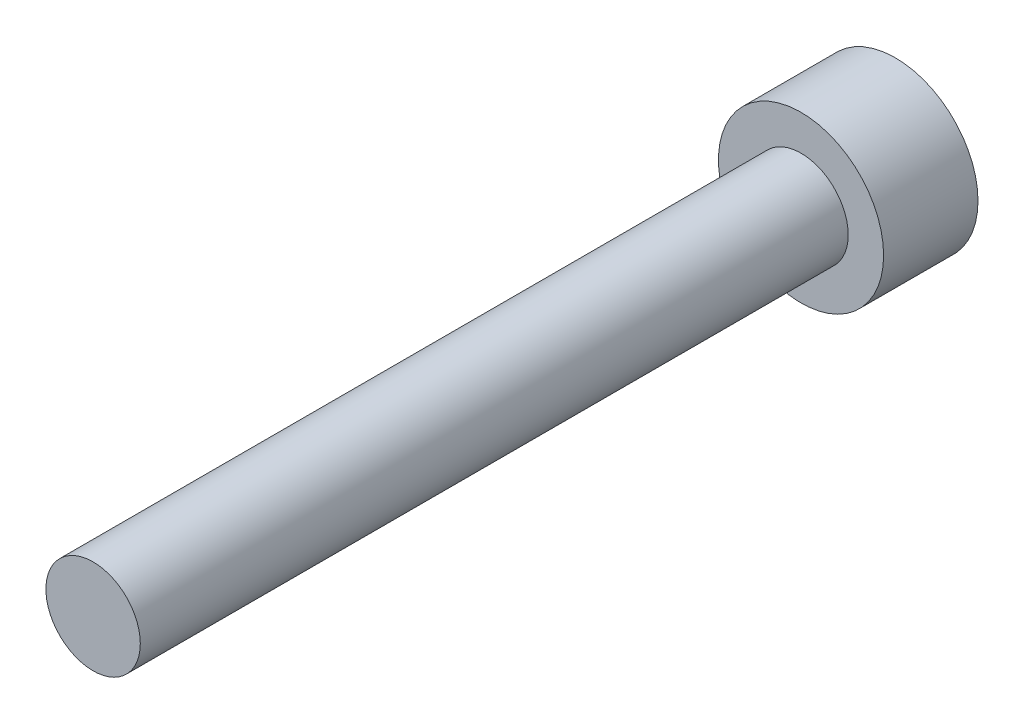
from build123d import *

# Parameters (mm, degrees)
HEAD_ENVELOPE_START             = -4
SKETCH_1_R                      = 3.5
HEAD_ENVELOPE_DEPTH             = 4
SKETCH_2_R                      = 2
SHANK_ENVELOPE_NO_THREADS_DEPTH = 30


with BuildPart() as part:
    # Sketch 1 → Head_envelope (new body)
    with BuildSketch(Plane.XY.offset(HEAD_ENVELOPE_START)):
        Circle(SKETCH_1_R)
    extrude(amount=HEAD_ENVELOPE_DEPTH)

    # Sketch 2 → Shank_envelope_no_threads (add)
    with BuildSketch(Plane.XY):
        Circle(SKETCH_2_R)
    extrude(amount=SHANK_ENVELOPE_NO_THREADS_DEPTH)


solid = part.part
